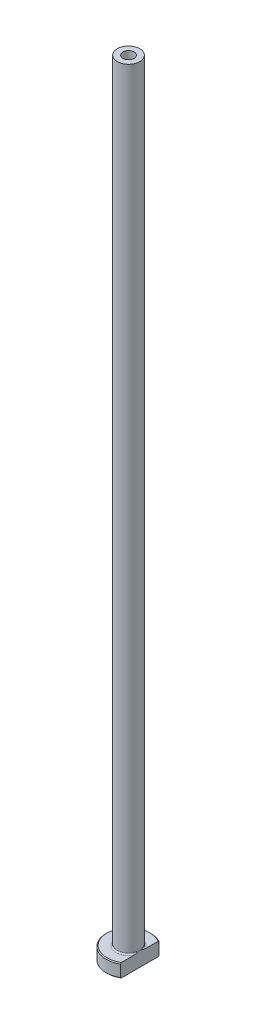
ISO-10303-21;
HEADER;
FILE_DESCRIPTION(('STEP AP214'),'2;1');
FILE_NAME('part.step','',(''),(''),'','','');
FILE_SCHEMA(('AUTOMOTIVE_DESIGN { 1 0 10303 214 1 1 1 1 }'));
ENDSEC;
DATA;
#1=APPLICATION_CONTEXT('core data for automotive mechanical design processes');
#2=APPLICATION_PROTOCOL_DEFINITION('international standard','automotive_design',2000,#1);
#3=PRODUCT_CONTEXT('',#1,'mechanical');
#4=PRODUCT('Part','Part','',(#3));
#5=PRODUCT_RELATED_PRODUCT_CATEGORY('part','',(#4));
#6=PRODUCT_DEFINITION_FORMATION('','',#4);
#7=PRODUCT_DEFINITION_CONTEXT('part definition',#1,'design');
#8=PRODUCT_DEFINITION('design','',#6,#7);
#9=PRODUCT_DEFINITION_SHAPE('','',#8);
#10=(LENGTH_UNIT() NAMED_UNIT(*) SI_UNIT(.MILLI.,.METRE.));
#11=(NAMED_UNIT(*) PLANE_ANGLE_UNIT() SI_UNIT($,.RADIAN.));
#12=(NAMED_UNIT(*) SI_UNIT($,.STERADIAN.) SOLID_ANGLE_UNIT());
#13=UNCERTAINTY_MEASURE_WITH_UNIT(LENGTH_MEASURE(1.E-05),#10,'distance_accuracy_value','');
#14=(GEOMETRIC_REPRESENTATION_CONTEXT(3) GLOBAL_UNCERTAINTY_ASSIGNED_CONTEXT((#13)) GLOBAL_UNIT_ASSIGNED_CONTEXT((#10,
#11,#12)) REPRESENTATION_CONTEXT('',''));
#15=CARTESIAN_POINT('',(0.,0.,0.));
#16=DIRECTION('',(0.,0.,1.));
#17=DIRECTION('',(1.,0.,0.));
#18=AXIS2_PLACEMENT_3D('',#15,#16,#17);
#19=CARTESIAN_POINT('',(0.,92.1876809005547,0.));
#20=DIRECTION('',(0.,1.,0.));
#21=DIRECTION('',(0.,0.,1.));
#22=AXIS2_PLACEMENT_3D('',#19,#20,#21);
#23=CYLINDRICAL_SURFACE('',#22,1.25);
#24=CARTESIAN_POINT('',(0.,175.,0.));
#25=DIRECTION('',(0.,1.,0.));
#26=DIRECTION('',(0.,0.,1.));
#27=AXIS2_PLACEMENT_3D('',#24,#25,#26);
#28=CIRCLE('',#27,1.25);
#29=CARTESIAN_POINT('',(0.,175.,1.25));
#30=VERTEX_POINT('',#29);
#31=EDGE_CURVE('E167',#30,#30,#28,.T.);
#32=ORIENTED_EDGE('',*,*,#31,.T.);
#33=EDGE_LOOP('',(#32));
#34=FACE_BOUND('',#33,.T.);
#35=CARTESIAN_POINT('',(0.,140.,0.));
#36=DIRECTION('',(0.,1.,0.));
#37=DIRECTION('',(0.,0.,1.));
#38=AXIS2_PLACEMENT_3D('',#35,#36,#37);
#39=CIRCLE('',#38,1.25);
#40=CARTESIAN_POINT('',(0.,140.,1.25));
#41=VERTEX_POINT('',#40);
#42=EDGE_CURVE('E170',#41,#41,#39,.T.);
#43=ORIENTED_EDGE('',*,*,#42,.F.);
#44=EDGE_LOOP('',(#43));
#45=FACE_BOUND('',#44,.T.);
#46=ADVANCED_FACE('F32',(#34,#45),#23,.F.);
#47=CARTESIAN_POINT('',(-1.25,175.,0.));
#48=DIRECTION('',(0.,1.,0.));
#49=DIRECTION('',(0.,0.,1.));
#50=AXIS2_PLACEMENT_3D('',#47,#48,#49);
#51=PLANE('',#50);
#52=CARTESIAN_POINT('',(0.,175.,0.));
#53=DIRECTION('',(0.,1.,0.));
#54=DIRECTION('',(0.,0.,1.));
#55=AXIS2_PLACEMENT_3D('',#52,#53,#54);
#56=CIRCLE('',#55,2.50000000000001);
#57=CARTESIAN_POINT('',(0.,175.,2.50000000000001));
#58=VERTEX_POINT('',#57);
#59=EDGE_CURVE('E174',#58,#58,#56,.T.);
#60=ORIENTED_EDGE('',*,*,#59,.T.);
#61=EDGE_LOOP('',(#60));
#62=FACE_BOUND('',#61,.T.);
#63=ORIENTED_EDGE('',*,*,#31,.F.);
#64=EDGE_LOOP('',(#63));
#65=FACE_BOUND('',#64,.T.);
#66=ADVANCED_FACE('F157',(#62,#65),#51,.T.);
#67=CARTESIAN_POINT('',(0.,92.1876809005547,0.));
#68=DIRECTION('',(0.,1.,0.));
#69=DIRECTION('',(0.,0.,1.));
#70=AXIS2_PLACEMENT_3D('',#67,#68,#69);
#71=CYLINDRICAL_SURFACE('',#70,2.5);
#72=CARTESIAN_POINT('',(0.,3.3,0.));
#73=DIRECTION('',(0.,1.,0.));
#74=DIRECTION('',(0.,0.,1.));
#75=AXIS2_PLACEMENT_3D('',#72,#73,#74);
#76=CIRCLE('',#75,2.5);
#77=CARTESIAN_POINT('',(2.5,3.3,0.));
#78=VERTEX_POINT('',#77);
#79=EDGE_CURVE('E180',#78,#78,#76,.T.);
#80=ORIENTED_EDGE('',*,*,#79,.T.);
#81=EDGE_LOOP('',(#80));
#82=FACE_BOUND('',#81,.T.);
#83=ORIENTED_EDGE('',*,*,#59,.F.);
#84=EDGE_LOOP('',(#83));
#85=FACE_BOUND('',#84,.T.);
#86=ADVANCED_FACE('F162',(#82,#85),#71,.T.);
#87=CARTESIAN_POINT('',(-2.49999999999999,3.,0.));
#88=DIRECTION('',(0.,1.,0.));
#89=DIRECTION('',(0.,0.,1.));
#90=AXIS2_PLACEMENT_3D('',#87,#88,#89);
#91=PLANE('',#90);
#92=DIRECTION('',(0.,0.,1.));
#93=VECTOR('',#92,1.);
#94=CARTESIAN_POINT('',(2.49999999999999,3.,0.));
#95=LINE('',#94,#93);
#96=CARTESIAN_POINT('',(2.5,3.,-4.09756024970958));
#97=VERTEX_POINT('',#96);
#98=CARTESIAN_POINT('',(2.49999999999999,3.,-1.26095202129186));
#99=VERTEX_POINT('',#98);
#100=EDGE_CURVE('E54',#97,#99,#95,.T.);
#101=ORIENTED_EDGE('',*,*,#100,.F.);
#102=CARTESIAN_POINT('',(0.,3.,0.));
#103=DIRECTION('',(0.,1.,0.));
#104=DIRECTION('',(0.,0.,1.));
#105=AXIS2_PLACEMENT_3D('',#102,#103,#104);
#106=CIRCLE('',#105,4.8);
#107=CARTESIAN_POINT('',(2.49999999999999,3.,4.09756024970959));
#108=VERTEX_POINT('',#107);
#109=EDGE_CURVE('E186',#97,#108,#106,.T.);
#110=ORIENTED_EDGE('',*,*,#109,.T.);
#111=CARTESIAN_POINT('',(2.49999999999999,3.,1.26095202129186));
#112=VERTEX_POINT('',#111);
#113=EDGE_CURVE('E134',#112,#108,#95,.T.);
#114=ORIENTED_EDGE('',*,*,#113,.F.);
#115=CARTESIAN_POINT('',(0.,3.,0.));
#116=DIRECTION('',(0.,1.,0.));
#117=DIRECTION('',(0.,0.,1.));
#118=AXIS2_PLACEMENT_3D('',#115,#116,#117);
#119=CIRCLE('',#118,2.8);
#120=EDGE_CURVE('E183',#112,#99,#119,.F.);
#121=ORIENTED_EDGE('',*,*,#120,.T.);
#122=EDGE_LOOP('',(#101,#110,#114,#121));
#123=FACE_BOUND('',#122,.T.);
#124=ADVANCED_FACE('F197',(#123),#91,.T.);
#125=CARTESIAN_POINT('',(0.,92.1876809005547,0.));
#126=DIRECTION('',(0.,1.,0.));
#127=DIRECTION('',(0.,0.,1.));
#128=AXIS2_PLACEMENT_3D('',#125,#126,#127);
#129=CYLINDRICAL_SURFACE('',#128,4.99999999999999);
#130=DIRECTION('',(0.,-1.,0.));
#131=VECTOR('',#130,1.);
#132=CARTESIAN_POINT('',(2.49999999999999,175.,4.33012701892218));
#133=LINE('',#132,#131);
#134=CARTESIAN_POINT('',(2.49999999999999,2.8,4.33012701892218));
#135=VERTEX_POINT('',#134);
#136=CARTESIAN_POINT('',(2.49999999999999,0.200000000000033,4.33012701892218));
#137=VERTEX_POINT('',#136);
#138=EDGE_CURVE('E82',#135,#137,#133,.T.);
#139=ORIENTED_EDGE('',*,*,#138,.F.);
#140=CARTESIAN_POINT('',(0.,2.8,0.));
#141=DIRECTION('',(0.,1.,0.));
#142=DIRECTION('',(0.,0.,1.));
#143=AXIS2_PLACEMENT_3D('',#140,#141,#142);
#144=CIRCLE('',#143,4.99999999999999);
#145=CARTESIAN_POINT('',(2.5,2.8,-4.33012701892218));
#146=VERTEX_POINT('',#145);
#147=EDGE_CURVE('E95',#135,#146,#144,.F.);
#148=ORIENTED_EDGE('',*,*,#147,.T.);
#149=DIRECTION('',(0.,-1.,0.));
#150=VECTOR('',#149,1.);
#151=CARTESIAN_POINT('',(2.5,175.,-4.33012701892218));
#152=LINE('',#151,#150);
#153=CARTESIAN_POINT('',(2.5,0.200000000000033,-4.33012701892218));
#154=VERTEX_POINT('',#153);
#155=EDGE_CURVE('E192',#146,#154,#152,.T.);
#156=ORIENTED_EDGE('',*,*,#155,.T.);
#157=CARTESIAN_POINT('',(0.,0.200000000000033,0.));
#158=DIRECTION('',(0.,-1.,0.));
#159=DIRECTION('',(0.,0.,-1.));
#160=AXIS2_PLACEMENT_3D('',#157,#158,#159);
#161=CIRCLE('',#160,4.99999999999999);
#162=EDGE_CURVE('E98',#154,#137,#161,.F.);
#163=ORIENTED_EDGE('',*,*,#162,.T.);
#164=EDGE_LOOP('',(#139,#148,#156,#163));
#165=FACE_BOUND('',#164,.T.);
#166=ADVANCED_FACE('F190',(#165),#129,.T.);
#167=CARTESIAN_POINT('',(-4.99999999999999,0.,0.));
#168=DIRECTION('',(0.,-1.,0.));
#169=DIRECTION('',(0.,0.,-1.));
#170=AXIS2_PLACEMENT_3D('',#167,#168,#169);
#171=PLANE('',#170);
#172=CARTESIAN_POINT('',(0.,0.,0.));
#173=DIRECTION('',(0.,-1.,0.));
#174=DIRECTION('',(0.,0.,-1.));
#175=AXIS2_PLACEMENT_3D('',#172,#173,#174);
#176=CIRCLE('',#175,1.99999999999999);
#177=CARTESIAN_POINT('',(0.,0.,-1.99999999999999));
#178=VERTEX_POINT('',#177);
#179=EDGE_CURVE('E40',#178,#178,#176,.F.);
#180=ORIENTED_EDGE('',*,*,#179,.T.);
#181=EDGE_LOOP('',(#180));
#182=FACE_BOUND('',#181,.T.);
#183=DIRECTION('',(0.,0.,-1.));
#184=VECTOR('',#183,1.);
#185=CARTESIAN_POINT('',(2.49999999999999,0.,4.33012701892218));
#186=LINE('',#185,#184);
#187=CARTESIAN_POINT('',(2.49999999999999,0.,4.09756024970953));
#188=VERTEX_POINT('',#187);
#189=CARTESIAN_POINT('',(2.5,0.,-4.09756024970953));
#190=VERTEX_POINT('',#189);
#191=EDGE_CURVE('E47',#188,#190,#186,.T.);
#192=ORIENTED_EDGE('',*,*,#191,.F.);
#193=CARTESIAN_POINT('',(0.,0.,0.));
#194=DIRECTION('',(0.,-1.,0.));
#195=DIRECTION('',(0.,0.,-1.));
#196=AXIS2_PLACEMENT_3D('',#193,#194,#195);
#197=CIRCLE('',#196,4.79999999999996);
#198=EDGE_CURVE('E92',#188,#190,#197,.T.);
#199=ORIENTED_EDGE('',*,*,#198,.T.);
#200=EDGE_LOOP('',(#192,#199));
#201=FACE_BOUND('',#200,.T.);
#202=ADVANCED_FACE('F91',(#182,#201),#171,.T.);
#203=CARTESIAN_POINT('',(0.,92.1876809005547,0.));
#204=DIRECTION('',(0.,1.,0.));
#205=DIRECTION('',(0.,0.,1.));
#206=AXIS2_PLACEMENT_3D('',#203,#204,#205);
#207=CYLINDRICAL_SURFACE('',#206,1.5);
#208=CARTESIAN_POINT('',(0.,0.499999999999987,0.));
#209=DIRECTION('',(0.,-1.,0.));
#210=DIRECTION('',(0.,0.,-1.));
#211=AXIS2_PLACEMENT_3D('',#208,#209,#210);
#212=CIRCLE('',#211,1.5);
#213=CARTESIAN_POINT('',(0.,0.499999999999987,-1.5));
#214=VERTEX_POINT('',#213);
#215=EDGE_CURVE('E11',#214,#214,#212,.T.);
#216=ORIENTED_EDGE('',*,*,#215,.T.);
#217=EDGE_LOOP('',(#216));
#218=FACE_BOUND('',#217,.T.);
#219=CARTESIAN_POINT('',(0.,128.,0.));
#220=DIRECTION('',(0.,1.,0.));
#221=DIRECTION('',(0.,0.,1.));
#222=AXIS2_PLACEMENT_3D('',#219,#220,#221);
#223=CIRCLE('',#222,1.50000000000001);
#224=CARTESIAN_POINT('',(0.,128.,1.50000000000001));
#225=VERTEX_POINT('',#224);
#226=EDGE_CURVE('E172',#225,#225,#223,.T.);
#227=ORIENTED_EDGE('',*,*,#226,.T.);
#228=EDGE_LOOP('',(#227));
#229=FACE_BOUND('',#228,.T.);
#230=ADVANCED_FACE('F215',(#218,#229),#207,.F.);
#231=CARTESIAN_POINT('',(0.,128.,0.));
#232=DIRECTION('',(0.,-1.,0.));
#233=DIRECTION('',(0.,0.,-1.));
#234=AXIS2_PLACEMENT_3D('',#231,#232,#233);
#235=CONICAL_SURFACE('',#234,1.50000000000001,0.0208303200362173);
#236=ORIENTED_EDGE('',*,*,#42,.T.);
#237=EDGE_LOOP('',(#236));
#238=FACE_BOUND('',#237,.T.);
#239=ORIENTED_EDGE('',*,*,#226,.F.);
#240=EDGE_LOOP('',(#239));
#241=FACE_BOUND('',#240,.T.);
#242=ADVANCED_FACE('F111',(#238,#241),#235,.F.);
#243=CARTESIAN_POINT('',(0.,3.3,0.));
#244=DIRECTION('',(0.,1.,0.));
#245=DIRECTION('',(0.,0.,1.));
#246=AXIS2_PLACEMENT_3D('',#243,#244,#245);
#247=TOROIDAL_SURFACE('',#246,2.8,0.3);
#248=ORIENTED_EDGE('',*,*,#120,.F.);
#249=CARTESIAN_POINT('',(2.5,3.3,0.));
#250=CARTESIAN_POINT('',(2.5,3.3000006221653,-4.84273808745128E-11));
#251=CARTESIAN_POINT('',(2.5,3.30000124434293,1.59621022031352E-07));
#252=CARTESIAN_POINT('',(2.5,3.30000243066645,6.45477892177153E-07));
#253=CARTESIAN_POINT('',(2.5,3.3000029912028,9.78480613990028E-07));
#254=CARTESIAN_POINT('',(2.5,3.3000041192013,1.77471968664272E-06));
#255=CARTESIAN_POINT('',(2.5,3.30000467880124,2.249021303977E-06));
#256=CARTESIAN_POINT('',(2.5,3.30000572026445,3.25953665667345E-06));
#257=CARTESIAN_POINT('',(2.5,3.30000620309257,3.79480728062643E-06));
#258=CARTESIAN_POINT('',(2.5,3.3000078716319,5.75794615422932E-06));
#259=CARTESIAN_POINT('',(2.5,3.30000896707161,7.2642410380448E-06));
#260=CARTESIAN_POINT('',(2.5,3.30001087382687,1.0336112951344E-05));
#261=CARTESIAN_POINT('',(2.5,3.30001169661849,1.18949499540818E-05));
#262=CARTESIAN_POINT('',(2.5,3.30001489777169,1.81400853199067E-05));
#263=CARTESIAN_POINT('',(2.5,3.300017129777,2.29062180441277E-05));
#264=CARTESIAN_POINT('',(2.5,3.30002067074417,3.21793870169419E-05));
#265=CARTESIAN_POINT('',(2.5,3.30002205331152,3.66588991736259E-05));
#266=CARTESIAN_POINT('',(2.5,3.30002810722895,5.61718409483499E-05));
#267=CARTESIAN_POINT('',(2.5,3.30003284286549,7.11735872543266E-05));
#268=CARTESIAN_POINT('',(2.49999999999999,3.30004025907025,9.89920336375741E-05));
#269=CARTESIAN_POINT('',(2.5,3.3000431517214,0.000111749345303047));
#270=CARTESIAN_POINT('',(2.5,3.30006652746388,0.000206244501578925));
#271=CARTESIAN_POINT('',(2.5,3.30009698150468,0.000285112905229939));
#272=CARTESIAN_POINT('',(2.49999999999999,3.30021213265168,0.000594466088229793));
#273=CARTESIAN_POINT('',(2.49999999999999,3.30028938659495,0.000826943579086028));
#274=CARTESIAN_POINT('',(2.5,3.30059681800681,0.0017388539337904));
#275=CARTESIAN_POINT('',(2.5,3.30083479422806,0.00241625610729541));
#276=CARTESIAN_POINT('',(2.49999999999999,3.30181198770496,0.00521069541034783));
#277=CARTESIAN_POINT('',(2.49999999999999,3.30254240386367,0.0073299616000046));
#278=CARTESIAN_POINT('',(2.5,3.31226043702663,0.0355096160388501));
#279=CARTESIAN_POINT('',(2.5,3.32130808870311,0.0615551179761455));
#280=CARTESIAN_POINT('',(2.49999999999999,3.33896212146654,0.112677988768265));
#281=CARTESIAN_POINT('',(2.49999999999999,3.34757212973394,0.137754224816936));
#282=CARTESIAN_POINT('',(2.5,3.36573068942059,0.190981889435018));
#283=CARTESIAN_POINT('',(2.5,3.37526654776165,0.219137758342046));
#284=CARTESIAN_POINT('',(2.5,3.39422867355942,0.275816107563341));
#285=CARTESIAN_POINT('',(2.5,3.40365272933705,0.304339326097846));
#286=CARTESIAN_POINT('',(2.5,3.42641697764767,0.374416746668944));
#287=CARTESIAN_POINT('',(2.5,3.43959811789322,0.416023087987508));
#288=CARTESIAN_POINT('',(2.5,3.46479157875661,0.49848190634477));
#289=CARTESIAN_POINT('',(2.5,3.47682455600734,0.539328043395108));
#290=CARTESIAN_POINT('',(2.5,3.50224427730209,0.629981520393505));
#291=CARTESIAN_POINT('',(2.5,3.51538048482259,0.679860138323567));
#292=CARTESIAN_POINT('',(2.5,3.53964074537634,0.7805117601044));
#293=CARTESIAN_POINT('',(2.5,3.55074877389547,0.831288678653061));
#294=CARTESIAN_POINT('',(2.5,3.57087054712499,0.937063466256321));
#295=CARTESIAN_POINT('',(2.5,3.57967623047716,0.992102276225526));
#296=CARTESIAN_POINT('',(2.5,3.59301148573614,1.10256024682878));
#297=CARTESIAN_POINT('',(2.5,3.59755297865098,1.15797790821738));
#298=CARTESIAN_POINT('',(2.5,3.60093314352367,1.26786705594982));
#299=CARTESIAN_POINT('',(2.5,3.59989366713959,1.32233291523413));
#300=CARTESIAN_POINT('',(2.5,3.59277279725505,1.40310062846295));
#301=CARTESIAN_POINT('',(2.5,3.58952137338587,1.42965222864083));
#302=CARTESIAN_POINT('',(2.5,3.58085857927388,1.48239078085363));
#303=CARTESIAN_POINT('',(2.5,3.57544928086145,1.50857805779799));
#304=CARTESIAN_POINT('',(2.5,3.56298810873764,1.55658799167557));
#305=CARTESIAN_POINT('',(2.5,3.5562820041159,1.5784990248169));
#306=CARTESIAN_POINT('',(2.5,3.5405539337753,1.62160292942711));
#307=CARTESIAN_POINT('',(2.5,3.5315222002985,1.64279233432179));
#308=CARTESIAN_POINT('',(2.5,3.51057199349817,1.68404469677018));
#309=CARTESIAN_POINT('',(2.5,3.49862012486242,1.70409105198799));
#310=CARTESIAN_POINT('',(2.5,3.47134074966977,1.74172093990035));
#311=CARTESIAN_POINT('',(2.5,3.45603127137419,1.75931683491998));
#312=CARTESIAN_POINT('',(2.5,3.42979930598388,1.78297070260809));
#313=CARTESIAN_POINT('',(2.5,3.42024268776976,1.79054141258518));
#314=CARTESIAN_POINT('',(2.5,3.40009035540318,1.80416997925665));
#315=CARTESIAN_POINT('',(2.5,3.3894949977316,1.81022835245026));
#316=CARTESIAN_POINT('',(2.5,3.36727740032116,1.82047087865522));
#317=CARTESIAN_POINT('',(2.5,3.3556453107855,1.82463409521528));
#318=CARTESIAN_POINT('',(2.5,3.33178837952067,1.83058442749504));
#319=CARTESIAN_POINT('',(2.5,3.31956435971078,1.83237474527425));
#320=CARTESIAN_POINT('',(2.5,3.29665736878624,1.83331852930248));
#321=CARTESIAN_POINT('',(2.5,3.2859867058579,1.83279233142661));
#322=CARTESIAN_POINT('',(2.5,3.26490749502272,1.82986307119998));
#323=CARTESIAN_POINT('',(2.5,3.25449899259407,1.82745968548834));
#324=CARTESIAN_POINT('',(2.5,3.23467098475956,1.82111257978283));
#325=CARTESIAN_POINT('',(2.5,3.22522816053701,1.81724026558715));
#326=CARTESIAN_POINT('',(2.5,3.20699535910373,1.80819497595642));
#327=CARTESIAN_POINT('',(2.5,3.19820556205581,1.80302164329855));
#328=CARTESIAN_POINT('',(2.5,3.17663162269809,1.78842115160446));
#329=CARTESIAN_POINT('',(2.5,3.16436228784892,1.7782329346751));
#330=CARTESIAN_POINT('',(2.5,3.14157828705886,1.75604629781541));
#331=CARTESIAN_POINT('',(2.5,3.13106906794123,1.74404246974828));
#332=CARTESIAN_POINT('',(2.5,3.10600520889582,1.71142114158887));
#333=CARTESIAN_POINT('',(2.5,3.09267476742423,1.68986887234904));
#334=CARTESIAN_POINT('',(2.5,3.06940323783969,1.64508572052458));
#335=CARTESIAN_POINT('',(2.5,3.05946314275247,1.62185434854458));
#336=CARTESIAN_POINT('',(2.5,3.03545750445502,1.55546754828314));
#337=CARTESIAN_POINT('',(2.5,3.02444022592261,1.51122187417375));
#338=CARTESIAN_POINT('',(2.5,3.00863926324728,1.4211977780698));
#339=CARTESIAN_POINT('',(2.5,3.00393876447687,1.37540689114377));
#340=CARTESIAN_POINT('',(2.5,2.9992421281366,1.28072198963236));
#341=CARTESIAN_POINT('',(2.5,2.99956098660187,1.23181420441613));
#342=CARTESIAN_POINT('',(2.5,3.00436098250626,1.13410944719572));
#343=CARTESIAN_POINT('',(2.5,3.00885327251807,1.0853131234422));
#344=CARTESIAN_POINT('',(2.5,3.02074191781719,0.990773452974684));
#345=CARTESIAN_POINT('',(2.5,3.02796792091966,0.94500781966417));
#346=CARTESIAN_POINT('',(2.5,3.04465555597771,0.854199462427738));
#347=CARTESIAN_POINT('',(2.5,3.05410250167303,0.809153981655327));
#348=CARTESIAN_POINT('',(2.5,3.07710029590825,0.709411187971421));
#349=CARTESIAN_POINT('',(2.5,3.09109633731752,0.654817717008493));
#350=CARTESIAN_POINT('',(2.5,3.12140740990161,0.54486362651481));
#351=CARTESIAN_POINT('',(2.49999999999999,3.13777040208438,0.489516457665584));
#352=CARTESIAN_POINT('',(2.5,3.16649540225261,0.396740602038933));
#353=CARTESIAN_POINT('',(2.5,3.17848130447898,0.359193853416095));
#354=CARTESIAN_POINT('',(2.49999999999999,3.20280507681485,0.284651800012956));
#355=CARTESIAN_POINT('',(2.49999999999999,3.21513791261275,0.247654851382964));
#356=CARTESIAN_POINT('',(2.5,3.23873713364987,0.177767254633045));
#357=CARTESIAN_POINT('',(2.5,3.24997409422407,0.144866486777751));
#358=CARTESIAN_POINT('',(2.49999999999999,3.27307149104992,0.0777985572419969));
#359=CARTESIAN_POINT('',(2.49999999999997,3.28493883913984,0.0436336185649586));
#360=CARTESIAN_POINT('',(2.5,3.29745794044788,0.0073287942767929));
#361=CARTESIAN_POINT('',(2.5,3.29818879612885,0.00520838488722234));
#362=CARTESIAN_POINT('',(2.49999999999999,3.29916610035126,0.00241367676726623));
#363=CARTESIAN_POINT('',(2.49999999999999,3.29940376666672,0.00173715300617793));
#364=CARTESIAN_POINT('',(2.5,3.29971082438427,0.000826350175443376));
#365=CARTESIAN_POINT('',(2.5,3.29978800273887,0.000594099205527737));
#366=CARTESIAN_POINT('',(2.49999999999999,3.299903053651,0.000285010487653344));
#367=CARTESIAN_POINT('',(2.49999999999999,3.2999334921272,0.000206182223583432));
#368=CARTESIAN_POINT('',(2.5,3.29995685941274,0.000111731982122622));
#369=CARTESIAN_POINT('',(2.5,3.29995975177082,9.89774327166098E-05));
#370=CARTESIAN_POINT('',(2.5,3.29996716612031,7.11651886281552E-05));
#371=CARTESIAN_POINT('',(2.5,3.29997189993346,5.61668096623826E-05));
#372=CARTESIAN_POINT('',(2.5,3.29997795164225,3.66576327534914E-05));
#373=CARTESIAN_POINT('',(2.5,3.2999793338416,3.21785244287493E-05));
#374=CARTESIAN_POINT('',(2.5,3.29998287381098,2.29061373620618E-05));
#375=CARTESIAN_POINT('',(2.5,3.2999851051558,1.81403659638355E-05));
#376=CARTESIAN_POINT('',(2.5,3.29998830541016,1.1895582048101E-05));
#377=CARTESIAN_POINT('',(2.5,3.29998912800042,1.03367760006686E-05));
#378=CARTESIAN_POINT('',(2.5,3.29999103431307,7.26492761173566E-06));
#379=CARTESIAN_POINT('',(2.5,3.29999212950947,5.75862257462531E-06));
#380=CARTESIAN_POINT('',(2.5,3.2999937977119,3.79542444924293E-06));
#381=CARTESIAN_POINT('',(2.5,3.29999428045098,3.26012738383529E-06));
#382=CARTESIAN_POINT('',(2.5,3.29999532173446,2.2495431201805E-06));
#383=CARTESIAN_POINT('',(2.5,3.29999588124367,1.77519875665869E-06));
#384=CARTESIAN_POINT('',(2.5,3.29999700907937,9.78856956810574E-07));
#385=CARTESIAN_POINT('',(2.5,3.29999756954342,6.45796946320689E-07));
#386=CARTESIAN_POINT('',(2.5,3.2999987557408,1.59799561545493E-07));
#387=CARTESIAN_POINT('',(2.5,3.29999937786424,4.84255823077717E-11));
#388=CARTESIAN_POINT('',(2.5,3.3,0.));
#389=B_SPLINE_CURVE_WITH_KNOTS('',3,(#249,#250,#251,#252,#253,#254,#255,#256,#257,#258,#259,
#260,#261,#262,#263,#264,#265,#266,#267,#268,#269,#270,#271,#272,#273,#274,#275,#276,#277,#278,
#279,#280,#281,#282,#283,#284,#285,#286,#287,#288,#289,#290,#291,#292,#293,#294,#295,#296,#297,
#298,#299,#300,#301,#302,#303,#304,#305,#306,#307,#308,#309,#310,#311,#312,#313,#314,#315,#316,
#317,#318,#319,#320,#321,#322,#323,#324,#325,#326,#327,#328,#329,#330,#331,#332,#333,#334,#335,
#336,#337,#338,#339,#340,#341,#342,#343,#344,#345,#346,#347,#348,#349,#350,#351,#352,#353,#354,
#355,#356,#357,#358,#359,#360,#361,#362,#363,#364,#365,#366,#367,#368,#369,#370,#371,#372,#373,
#374,#375,#376,#377,#378,#379,#380,#381,#382,#383,#384,#385,#386,#387,#388),.UNSPECIFIED.,.T.,
.F.,(4,2,2,2,2,2,2,2,2,2,2,2,2,2,2,2,2,2,2,2,2,2,2,2,2,2,2,2,2,2,2,2,2,2,2,2,2,2,2,2,2,2,2,2,2,
2,2,2,2,2,2,2,2,2,2,2,2,2,2,2,2,2,2,2,2,2,2,2,2,4),(0.,1.86789240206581E-06,
3.81549625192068E-06,6.00610486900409E-06,8.16652987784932E-06,1.37285591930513E-05,
1.90122173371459E-05,3.47597293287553E-05,4.88082622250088E-05,9.59978452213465E-05,
0.000135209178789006,0.000388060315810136,0.00112364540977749,0.0032767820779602,
0.0100024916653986,0.0927120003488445,0.172253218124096,0.261432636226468,0.351551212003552,
0.48247714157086,0.610212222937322,0.76491521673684,0.920792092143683,1.08787897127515,
1.25449733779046,1.41749285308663,1.49767530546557,1.57778095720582,1.6464248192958,
1.71536183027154,1.78512750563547,1.8545273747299,1.89099315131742,1.92744645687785,
1.96429324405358,2.00109025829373,2.0329710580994,2.06485735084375,2.09535926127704,
2.12586955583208,2.17344034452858,2.2211557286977,2.29675134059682,2.37236907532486,
2.50839721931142,2.64619971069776,2.79268284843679,2.93955855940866,3.07848421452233,
3.21651583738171,3.38554045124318,3.55865938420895,3.67689643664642,3.79388863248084,
3.89819085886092,4.00668323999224,4.01341261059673,4.01556295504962,4.01629782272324,
4.01655054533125,4.01658974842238,4.01663692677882,4.01665097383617,4.01666671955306,
4.01667200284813,4.01667756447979,4.01667972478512,4.01668191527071,4.01668386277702,
4.01668573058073),.UNSPECIFIED.);
#390=EDGE_CURVE('E126',#112,#78,#389,.T.);
#391=ORIENTED_EDGE('',*,*,#390,.T.);
#392=ORIENTED_EDGE('',*,*,#79,.F.);
#393=CARTESIAN_POINT('',(2.5,3.3,0.));
#394=CARTESIAN_POINT('',(2.5,3.2999993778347,4.84277324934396E-11));
#395=CARTESIAN_POINT('',(2.5,3.29999875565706,-1.596210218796E-07));
#396=CARTESIAN_POINT('',(2.5,3.29999756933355,-6.45477892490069E-07));
#397=CARTESIAN_POINT('',(2.5,3.2999970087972,-9.78480614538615E-07));
#398=CARTESIAN_POINT('',(2.5,3.2999958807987,-1.77471968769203E-06));
#399=CARTESIAN_POINT('',(2.5,3.29999532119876,-2.2490213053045E-06));
#400=CARTESIAN_POINT('',(2.5,3.29999427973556,-3.25953665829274E-06));
#401=CARTESIAN_POINT('',(2.5,3.29999379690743,-3.79480728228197E-06));
#402=CARTESIAN_POINT('',(2.5,3.2999921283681,-5.75794615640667E-06));
#403=CARTESIAN_POINT('',(2.5,3.29999103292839,-7.26424104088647E-06));
#404=CARTESIAN_POINT('',(2.5,3.29998912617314,-1.03361129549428E-05));
#405=CARTESIAN_POINT('',(2.5,3.29998830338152,-1.18949499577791E-05));
#406=CARTESIAN_POINT('',(2.5,3.29998510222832,-1.81400853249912E-05));
#407=CARTESIAN_POINT('',(2.5,3.29998287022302,-2.29062180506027E-05));
#408=CARTESIAN_POINT('',(2.5,3.29997932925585,-3.21793870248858E-05));
#409=CARTESIAN_POINT('',(2.5,3.2999779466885,-3.66588991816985E-05));
#410=CARTESIAN_POINT('',(2.5,3.29997189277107,-5.61718409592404E-05));
#411=CARTESIAN_POINT('',(2.5,3.29996715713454,-7.11735872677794E-05));
#412=CARTESIAN_POINT('',(2.5,3.29995974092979,-9.89920336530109E-05));
#413=CARTESIAN_POINT('',(2.5,3.29995684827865,-0.000111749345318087));
#414=CARTESIAN_POINT('',(2.49999999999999,3.29993347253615,-0.000206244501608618));
#415=CARTESIAN_POINT('',(2.49999999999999,3.29990301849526,-0.000285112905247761));
#416=CARTESIAN_POINT('',(2.5,3.29978786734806,-0.000594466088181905));
#417=CARTESIAN_POINT('',(2.5,3.29971061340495,-0.000826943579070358));
#418=CARTESIAN_POINT('',(2.49999999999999,3.29940318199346,-0.00173885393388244));
#419=CARTESIAN_POINT('',(2.49999999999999,3.29916520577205,-0.00241625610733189));
#420=CARTESIAN_POINT('',(2.5,3.29818801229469,-0.00521069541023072));
#421=CARTESIAN_POINT('',(2.5,3.29745759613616,-0.00732996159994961));
#422=CARTESIAN_POINT('',(2.49999999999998,3.28773956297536,-0.0355096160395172));
#423=CARTESIAN_POINT('',(2.49999999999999,3.27869191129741,-0.061555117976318));
#424=CARTESIAN_POINT('',(2.5,3.26103787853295,-0.112677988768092));
#425=CARTESIAN_POINT('',(2.5,3.25242787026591,-0.137754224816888));
#426=CARTESIAN_POINT('',(2.49999999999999,3.23426931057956,-0.190981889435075));
#427=CARTESIAN_POINT('',(2.49999999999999,3.22473345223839,-0.219137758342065));
#428=CARTESIAN_POINT('',(2.5,3.20577132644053,-0.275816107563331));
#429=CARTESIAN_POINT('',(2.5,3.19634727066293,-0.304339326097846));
#430=CARTESIAN_POINT('',(2.5,3.17358302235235,-0.374416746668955));
#431=CARTESIAN_POINT('',(2.5,3.16040188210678,-0.416023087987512));
#432=CARTESIAN_POINT('',(2.5,3.13520842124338,-0.498481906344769));
#433=CARTESIAN_POINT('',(2.5,3.12317544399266,-0.539328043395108));
#434=CARTESIAN_POINT('',(2.5,3.0977557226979,-0.629981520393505));
#435=CARTESIAN_POINT('',(2.5,3.0846195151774,-0.679860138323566));
#436=CARTESIAN_POINT('',(2.5,3.06035925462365,-0.780511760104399));
#437=CARTESIAN_POINT('',(2.5,3.04925122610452,-0.83128867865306));
#438=CARTESIAN_POINT('',(2.5,3.02912945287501,-0.93706346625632));
#439=CARTESIAN_POINT('',(2.5,3.02032376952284,-0.992102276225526));
#440=CARTESIAN_POINT('',(2.5,3.00698851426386,-1.10256024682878));
#441=CARTESIAN_POINT('',(2.5,3.00244702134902,-1.15797790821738));
#442=CARTESIAN_POINT('',(2.5,2.99906685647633,-1.26786705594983));
#443=CARTESIAN_POINT('',(2.5,3.00010633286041,-1.32233291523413));
#444=CARTESIAN_POINT('',(2.5,3.00722720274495,-1.40310062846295));
#445=CARTESIAN_POINT('',(2.5,3.01047862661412,-1.42965222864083));
#446=CARTESIAN_POINT('',(2.5,3.01914142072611,-1.48239078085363));
#447=CARTESIAN_POINT('',(2.5,3.02455071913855,-1.508578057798));
#448=CARTESIAN_POINT('',(2.5,3.03701189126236,-1.55658799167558));
#449=CARTESIAN_POINT('',(2.5,3.0437179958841,-1.57849902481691));
#450=CARTESIAN_POINT('',(2.5,3.0594460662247,-1.62160292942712));
#451=CARTESIAN_POINT('',(2.5,3.06847779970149,-1.64279233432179));
#452=CARTESIAN_POINT('',(2.5,3.08942800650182,-1.68404469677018));
#453=CARTESIAN_POINT('',(2.5,3.10137987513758,-1.70409105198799));
#454=CARTESIAN_POINT('',(2.5,3.12865925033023,-1.74172093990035));
#455=CARTESIAN_POINT('',(2.5,3.14396872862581,-1.75931683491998));
#456=CARTESIAN_POINT('',(2.5,3.17020069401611,-1.78297070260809));
#457=CARTESIAN_POINT('',(2.5,3.17975731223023,-1.79054141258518));
#458=CARTESIAN_POINT('',(2.5,3.19990964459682,-1.80416997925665));
#459=CARTESIAN_POINT('',(2.5,3.21050500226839,-1.81022835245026));
#460=CARTESIAN_POINT('',(2.5,3.23272259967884,-1.82047087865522));
#461=CARTESIAN_POINT('',(2.5,3.2443546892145,-1.82463409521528));
#462=CARTESIAN_POINT('',(2.5,3.26821162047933,-1.83058442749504));
#463=CARTESIAN_POINT('',(2.5,3.28043564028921,-1.83237474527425));
#464=CARTESIAN_POINT('',(2.5,3.30334263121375,-1.83331852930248));
#465=CARTESIAN_POINT('',(2.5,3.3140132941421,-1.83279233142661));
#466=CARTESIAN_POINT('',(2.5,3.33509250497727,-1.82986307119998));
#467=CARTESIAN_POINT('',(2.5,3.34550100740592,-1.82745968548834));
#468=CARTESIAN_POINT('',(2.5,3.36532901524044,-1.82111257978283));
#469=CARTESIAN_POINT('',(2.5,3.37477183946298,-1.81724026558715));
#470=CARTESIAN_POINT('',(2.5,3.39300464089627,-1.80819497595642));
#471=CARTESIAN_POINT('',(2.5,3.40179443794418,-1.80302164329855));
#472=CARTESIAN_POINT('',(2.5,3.4233683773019,-1.78842115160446));
#473=CARTESIAN_POINT('',(2.5,3.43563771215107,-1.7782329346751));
#474=CARTESIAN_POINT('',(2.5,3.45842171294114,-1.75604629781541));
#475=CARTESIAN_POINT('',(2.5,3.46893093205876,-1.74404246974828));
#476=CARTESIAN_POINT('',(2.5,3.49399479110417,-1.71142114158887));
#477=CARTESIAN_POINT('',(2.5,3.50732523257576,-1.68986887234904));
#478=CARTESIAN_POINT('',(2.5,3.53059676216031,-1.64508572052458));
#479=CARTESIAN_POINT('',(2.5,3.54053685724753,-1.62185434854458));
#480=CARTESIAN_POINT('',(2.5,3.56454249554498,-1.55546754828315));
#481=CARTESIAN_POINT('',(2.5,3.57555977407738,-1.51122187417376));
#482=CARTESIAN_POINT('',(2.5,3.59136073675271,-1.4211977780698));
#483=CARTESIAN_POINT('',(2.5,3.59606123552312,-1.37540689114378));
#484=CARTESIAN_POINT('',(2.5,3.6007578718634,-1.28072198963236));
#485=CARTESIAN_POINT('',(2.5,3.60043901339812,-1.23181420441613));
#486=CARTESIAN_POINT('',(2.5,3.59563901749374,-1.13410944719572));
#487=CARTESIAN_POINT('',(2.5,3.59114672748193,-1.08531312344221));
#488=CARTESIAN_POINT('',(2.5,3.57925808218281,-0.990773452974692));
#489=CARTESIAN_POINT('',(2.5,3.57203207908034,-0.945007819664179));
#490=CARTESIAN_POINT('',(2.5,3.55534444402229,-0.854199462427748));
#491=CARTESIAN_POINT('',(2.5,3.54589749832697,-0.809153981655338));
#492=CARTESIAN_POINT('',(2.5,3.52289970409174,-0.709411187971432));
#493=CARTESIAN_POINT('',(2.5,3.50890366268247,-0.654817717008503));
#494=CARTESIAN_POINT('',(2.5,3.47859259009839,-0.544863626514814));
#495=CARTESIAN_POINT('',(2.49999999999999,3.46222959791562,-0.489516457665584));
#496=CARTESIAN_POINT('',(2.5,3.43350459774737,-0.396740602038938));
#497=CARTESIAN_POINT('',(2.5,3.42151869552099,-0.359193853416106));
#498=CARTESIAN_POINT('',(2.49999999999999,3.39719492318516,-0.284651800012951));
#499=CARTESIAN_POINT('',(2.49999999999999,3.38486208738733,-0.247654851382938));
#500=CARTESIAN_POINT('',(2.5,3.36126286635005,-0.177767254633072));
#501=CARTESIAN_POINT('',(2.5,3.35002590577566,-0.144866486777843));
#502=CARTESIAN_POINT('',(2.49999999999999,3.32692850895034,-0.0777985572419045));
#503=CARTESIAN_POINT('',(2.49999999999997,3.31506116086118,-0.0436336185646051));
#504=CARTESIAN_POINT('',(2.5,3.30254205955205,-0.00732879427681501));
#505=CARTESIAN_POINT('',(2.5,3.30181120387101,-0.00520838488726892));
#506=CARTESIAN_POINT('',(2.49999999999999,3.30083389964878,-0.00241367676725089));
#507=CARTESIAN_POINT('',(2.49999999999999,3.30059623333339,-0.00173715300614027));
#508=CARTESIAN_POINT('',(2.5,3.30028917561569,-0.000826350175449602));
#509=CARTESIAN_POINT('',(2.5,3.30021199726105,-0.000594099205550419));
#510=CARTESIAN_POINT('',(2.49999999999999,3.30009694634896,-0.000285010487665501));
#511=CARTESIAN_POINT('',(2.49999999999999,3.30006650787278,-0.000206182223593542));
#512=CARTESIAN_POINT('',(2.5,3.30004314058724,-0.000111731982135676));
#513=CARTESIAN_POINT('',(2.5,3.30004024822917,-9.89774327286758E-05));
#514=CARTESIAN_POINT('',(2.5,3.30003283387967,-7.11651886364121E-05));
#515=CARTESIAN_POINT('',(2.5,3.30002810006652,-5.61668096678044E-05));
#516=CARTESIAN_POINT('',(2.5,3.30002204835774,-3.66576327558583E-05));
#517=CARTESIAN_POINT('',(2.5,3.30002066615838,-3.21785244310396E-05));
#518=CARTESIAN_POINT('',(2.5,3.300017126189,-2.29061373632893E-05));
#519=CARTESIAN_POINT('',(2.5,3.30001489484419,-1.81403659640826E-05));
#520=CARTESIAN_POINT('',(2.5,3.30001169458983,-1.18955820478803E-05));
#521=CARTESIAN_POINT('',(2.5,3.30001087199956,-1.03367760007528E-05));
#522=CARTESIAN_POINT('',(2.5,3.30000896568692,-7.26492761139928E-06));
#523=CARTESIAN_POINT('',(2.5,3.30000787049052,-5.75862257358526E-06));
#524=CARTESIAN_POINT('',(2.5,3.30000620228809,-3.79542444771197E-06));
#525=CARTESIAN_POINT('',(2.5,3.30000571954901,-3.26012738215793E-06));
#526=CARTESIAN_POINT('',(2.5,3.30000467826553,-2.24954311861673E-06));
#527=CARTESIAN_POINT('',(2.5,3.30000411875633,-1.77519875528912E-06));
#528=CARTESIAN_POINT('',(2.5,3.30000299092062,-9.78856955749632E-07));
#529=CARTESIAN_POINT('',(2.5,3.30000243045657,-6.45796945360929E-07));
#530=CARTESIAN_POINT('',(2.5,3.30000124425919,-1.59799560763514E-07));
#531=CARTESIAN_POINT('',(2.5,3.30000062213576,-4.8424932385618E-11));
#532=CARTESIAN_POINT('',(2.5,3.3,0.));
#533=B_SPLINE_CURVE_WITH_KNOTS('',3,(#393,#394,#395,#396,#397,#398,#399,#400,#401,#402,#403,
#404,#405,#406,#407,#408,#409,#410,#411,#412,#413,#414,#415,#416,#417,#418,#419,#420,#421,#422,
#423,#424,#425,#426,#427,#428,#429,#430,#431,#432,#433,#434,#435,#436,#437,#438,#439,#440,#441,
#442,#443,#444,#445,#446,#447,#448,#449,#450,#451,#452,#453,#454,#455,#456,#457,#458,#459,#460,
#461,#462,#463,#464,#465,#466,#467,#468,#469,#470,#471,#472,#473,#474,#475,#476,#477,#478,#479,
#480,#481,#482,#483,#484,#485,#486,#487,#488,#489,#490,#491,#492,#493,#494,#495,#496,#497,#498,
#499,#500,#501,#502,#503,#504,#505,#506,#507,#508,#509,#510,#511,#512,#513,#514,#515,#516,#517,
#518,#519,#520,#521,#522,#523,#524,#525,#526,#527,#528,#529,#530,#531,#532),.UNSPECIFIED.,.T.,
.F.,(4,2,2,2,2,2,2,2,2,2,2,2,2,2,2,2,2,2,2,2,2,2,2,2,2,2,2,2,2,2,2,2,2,2,2,2,2,2,2,2,2,2,2,2,2,
2,2,2,2,2,2,2,2,2,2,2,2,2,2,2,2,2,2,2,2,2,2,2,2,4),(0.,1.86789240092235E-06,
3.81549624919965E-06,6.0061048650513E-06,8.16652987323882E-06,1.37285591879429E-05,
1.90122173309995E-05,3.47597293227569E-05,4.88082622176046E-05,9.59978452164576E-05,
0.000135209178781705,0.000388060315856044,0.00112364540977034,0.00327678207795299,
0.0100024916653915,0.0927120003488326,0.172253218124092,0.261432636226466,0.35155121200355,
0.482477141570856,0.610212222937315,0.764915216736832,0.920792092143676,1.08787897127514,
1.25449733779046,1.41749285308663,1.49767530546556,1.57778095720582,1.64642481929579,
1.71536183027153,1.78512750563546,1.85452737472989,1.89099315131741,1.92744645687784,
1.96429324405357,2.00109025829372,2.03297105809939,2.06485735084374,2.09535926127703,
2.12586955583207,2.17344034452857,2.2211557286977,2.29675134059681,2.37236907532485,
2.50839721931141,2.64619971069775,2.79268284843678,2.93955855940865,3.07848421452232,
3.21651583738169,3.38554045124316,3.55865938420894,3.67689643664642,3.79388863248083,
3.89819085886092,4.00668323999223,4.01341261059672,4.01556295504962,4.01629782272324,
4.01655054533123,4.01658974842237,4.01663692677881,4.01665097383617,4.01666671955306,
4.01667200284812,4.01667756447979,4.01667972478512,4.01668191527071,4.01668386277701,
4.01668573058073),.UNSPECIFIED.);
#534=EDGE_CURVE('E135',#78,#99,#533,.T.);
#535=ORIENTED_EDGE('',*,*,#534,.T.);
#536=EDGE_LOOP('',(#248,#391,#392,#535));
#537=FACE_BOUND('',#536,.T.);
#538=ADVANCED_FACE('F141',(#537),#247,.F.);
#539=CARTESIAN_POINT('',(0.,3.,0.));
#540=DIRECTION('',(0.,-1.,0.));
#541=DIRECTION('',(0.,0.,-1.));
#542=AXIS2_PLACEMENT_3D('',#539,#540,#541);
#543=CONICAL_SURFACE('',#542,4.8,0.785398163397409);
#544=CARTESIAN_POINT('',(2.5,-2.05039133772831,-9.52786489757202));
#545=CARTESIAN_POINT('',(2.5,-1.84160367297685,-9.31199733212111));
#546=CARTESIAN_POINT('',(2.5,-1.63304008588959,-9.09591231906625));
#547=CARTESIAN_POINT('',(2.5,-1.21649358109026,-8.66317810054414));
#548=CARTESIAN_POINT('',(2.5,-1.00851067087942,-8.44652888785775));
#549=CARTESIAN_POINT('',(2.5,-0.593157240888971,-8.01243155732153));
#550=CARTESIAN_POINT('',(2.5,-0.385787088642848,-7.79498308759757));
#551=CARTESIAN_POINT('',(2.5,0.0280365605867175,-7.35921771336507));
#552=CARTESIAN_POINT('',(2.5,0.234490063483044,-7.14090081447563));
#553=CARTESIAN_POINT('',(2.5,0.642130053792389,-6.70748960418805));
#554=CARTESIAN_POINT('',(2.5,0.84333981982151,-6.49241720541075));
#555=CARTESIAN_POINT('',(2.5,1.24425381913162,-6.06087422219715));
#556=CARTESIAN_POINT('',(2.5,1.44395806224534,-5.84440364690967));
#557=CARTESIAN_POINT('',(2.5,1.84127751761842,-5.40963663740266));
#558=CARTESIAN_POINT('',(2.5,2.03889317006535,-5.19134060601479));
#559=CARTESIAN_POINT('',(2.5,2.43125043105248,-4.75218509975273));
#560=CARTESIAN_POINT('',(2.5,2.62599215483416,-4.53132572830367));
#561=CARTESIAN_POINT('',(2.5,2.93693788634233,-4.17181619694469));
#562=CARTESIAN_POINT('',(2.5,3.0544649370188,-4.03431188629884));
#563=CARTESIAN_POINT('',(2.5,3.28742704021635,-3.75751486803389));
#564=CARTESIAN_POINT('',(2.5,3.40286188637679,-3.61822198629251));
#565=CARTESIAN_POINT('',(2.5,3.63213234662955,-3.33586492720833));
#566=CARTESIAN_POINT('',(2.5,3.74593818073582,-3.19277645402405));
#567=CARTESIAN_POINT('',(2.5,3.96956266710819,-2.90356071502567));
#568=CARTESIAN_POINT('',(2.5,4.07938227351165,-2.75743418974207));
#569=CARTESIAN_POINT('',(2.5,4.29502410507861,-2.45881038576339));
#570=CARTESIAN_POINT('',(2.5,4.4007603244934,-2.30625006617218));
#571=CARTESIAN_POINT('',(2.5,4.55286945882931,-2.07299325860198));
#572=CARTESIAN_POINT('',(2.5,4.60252613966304,-1.99444197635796));
#573=CARTESIAN_POINT('',(2.5,4.69908164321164,-1.8356682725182));
#574=CARTESIAN_POINT('',(2.5,4.74598077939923,-1.75544604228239));
#575=CARTESIAN_POINT('',(2.5,4.83578466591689,-1.59405362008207));
#576=CARTESIAN_POINT('',(2.5,4.87873126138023,-1.51290702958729));
#577=CARTESIAN_POINT('',(2.5,4.96038600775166,-1.34852090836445));
#578=CARTESIAN_POINT('',(2.5,4.99909338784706,-1.26528100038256));
#579=CARTESIAN_POINT('',(2.5,5.1070309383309,-1.01251774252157));
#580=CARTESIAN_POINT('',(2.5,5.16843307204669,-0.83934206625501));
#581=CARTESIAN_POINT('',(2.5,5.23490554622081,-0.579703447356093));
#582=CARTESIAN_POINT('',(2.5,5.25253806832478,-0.496421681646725));
#583=CARTESIAN_POINT('',(2.5,5.2798633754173,-0.328535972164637));
#584=CARTESIAN_POINT('',(2.5,5.28955686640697,-0.243932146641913));
#585=CARTESIAN_POINT('',(2.5,5.30031768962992,-0.0744340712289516));
#586=CARTESIAN_POINT('',(2.5,5.30141176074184,0.0104584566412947));
#587=CARTESIAN_POINT('',(2.5,5.29496530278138,0.179916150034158));
#588=CARTESIAN_POINT('',(2.5,5.28742406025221,0.264481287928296));
#589=CARTESIAN_POINT('',(2.5,5.26433424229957,0.431754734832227));
#590=CARTESIAN_POINT('',(2.5,5.2488543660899,0.5144727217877));
#591=CARTESIAN_POINT('',(2.5,5.21085318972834,0.678257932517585));
#592=CARTESIAN_POINT('',(2.5,5.18833104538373,0.759324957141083));
#593=CARTESIAN_POINT('',(2.5,5.13718929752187,0.920001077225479));
#594=CARTESIAN_POINT('',(2.5,5.10853534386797,0.999599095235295));
#595=CARTESIAN_POINT('',(2.5,5.0462809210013,1.15679278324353));
#596=CARTESIAN_POINT('',(2.5,5.01268146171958,1.2343888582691));
#597=CARTESIAN_POINT('',(2.5,4.90558195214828,1.46503672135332));
#598=CARTESIAN_POINT('',(2.5,4.82601567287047,1.6152635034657));
#599=CARTESIAN_POINT('',(2.5,4.65635232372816,1.909707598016));
#600=CARTESIAN_POINT('',(2.49999999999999,4.56624199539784,2.0539170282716));
#601=CARTESIAN_POINT('',(2.49999999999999,4.37862201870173,2.33821627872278));
#602=CARTESIAN_POINT('',(2.49999999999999,4.28108460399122,2.47828761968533));
#603=CARTESIAN_POINT('',(2.49999999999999,4.08116271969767,2.75478641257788));
#604=CARTESIAN_POINT('',(2.49999999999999,3.97878070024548,2.89121565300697));
#605=CARTESIAN_POINT('',(2.49999999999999,3.76913910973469,3.16313520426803));
#606=CARTESIAN_POINT('',(2.49999999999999,3.66183307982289,3.29858952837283));
#607=CARTESIAN_POINT('',(2.49999999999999,3.44456217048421,3.56736427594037));
#608=CARTESIAN_POINT('',(2.49999999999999,3.33459700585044,3.70068446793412));
#609=CARTESIAN_POINT('',(2.49999999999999,3.11293465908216,3.96532340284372));
#610=CARTESIAN_POINT('',(2.49999999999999,3.00124232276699,4.0966462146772));
#611=CARTESIAN_POINT('',(2.49999999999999,2.77631276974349,4.35796341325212));
#612=CARTESIAN_POINT('',(2.49999999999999,2.66307552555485,4.48795777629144));
#613=CARTESIAN_POINT('',(2.49999999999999,2.36028773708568,4.83228553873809));
#614=CARTESIAN_POINT('',(2.49999999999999,2.16967435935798,5.04568363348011));
#615=CARTESIAN_POINT('',(2.49999999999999,1.78611780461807,5.47037913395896));
#616=CARTESIAN_POINT('',(2.49999999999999,1.59317456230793,5.68167648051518));
#617=CARTESIAN_POINT('',(2.49999999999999,1.20540648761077,6.10290357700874));
#618=CARTESIAN_POINT('',(2.49999999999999,1.01058005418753,6.3128318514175));
#619=CARTESIAN_POINT('',(2.49999999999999,0.619649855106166,6.73149551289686));
#620=CARTESIAN_POINT('',(2.49999999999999,0.423546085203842,6.94023089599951));
#621=CARTESIAN_POINT('',(2.49999999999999,0.0384434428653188,7.3482039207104));
#622=CARTESIAN_POINT('',(2.49999999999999,-0.150515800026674,7.54747899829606));
#623=CARTESIAN_POINT('',(2.49999999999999,-0.529153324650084,7.94534601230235));
#624=CARTESIAN_POINT('',(2.49999999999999,-0.7188316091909,8.14393794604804));
#625=CARTESIAN_POINT('',(2.49999999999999,-1.09855461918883,8.54034636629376));
#626=CARTESIAN_POINT('',(2.49999999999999,-1.28859869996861,8.73816347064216));
#627=CARTESIAN_POINT('',(2.49999999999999,-1.66916268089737,9.13333639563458));
#628=CARTESIAN_POINT('',(2.49999999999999,-1.85968257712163,9.33069222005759));
#629=CARTESIAN_POINT('',(2.49999999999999,-2.0503913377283,9.52786489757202));
#630=B_SPLINE_CURVE_WITH_KNOTS('',3,(#544,#545,#546,#547,#548,#549,#550,#551,#552,#553,#554,
#555,#556,#557,#558,#559,#560,#561,#562,#563,#564,#565,#566,#567,#568,#569,#570,#571,#572,#573,
#574,#575,#576,#577,#578,#579,#580,#581,#582,#583,#584,#585,#586,#587,#588,#589,#590,#591,#592,
#593,#594,#595,#596,#597,#598,#599,#600,#601,#602,#603,#604,#605,#606,#607,#608,#609,#610,#611,
#612,#613,#614,#615,#616,#617,#618,#619,#620,#621,#622,#623,#624,#625,#626,#627,#628,#629),
.UNSPECIFIED.,.F.,.F.,(4,2,2,2,2,2,2,2,2,2,2,2,2,2,2,2,2,2,2,2,2,2,2,2,2,2,2,2,2,2,2,2,2,2,2,2,
2,2,2,2,2,2,4),(0.,0.900955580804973,1.80192274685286,2.70335062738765,3.60477268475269,
4.48832484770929,5.37187123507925,6.25522753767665,7.13854832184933,7.68119321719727,
8.22389134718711,8.7723229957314,9.32062249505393,9.87724663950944,10.1559936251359,
10.4347088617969,10.7100145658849,10.98537024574,11.5339745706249,11.7890461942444,
12.0440951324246,12.2983507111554,12.5526272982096,12.8047396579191,13.0568822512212,
13.3104761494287,13.5640183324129,14.0732618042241,14.5831526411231,15.0950533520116,
15.6066978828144,16.1250759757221,16.6435099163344,17.1606868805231,17.6778730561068,
18.5362451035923,19.3946412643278,20.2538459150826,21.1130534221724,21.9369112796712,
22.7607723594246,23.5837145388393,24.4066499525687),.UNSPECIFIED.);
#631=EDGE_CURVE('E133',#146,#97,#630,.T.);
#632=ORIENTED_EDGE('',*,*,#631,.F.);
#633=ORIENTED_EDGE('',*,*,#147,.F.);
#634=EDGE_CURVE('E118',#108,#135,#630,.T.);
#635=ORIENTED_EDGE('',*,*,#634,.F.);
#636=ORIENTED_EDGE('',*,*,#109,.F.);
#637=EDGE_LOOP('',(#632,#633,#635,#636));
#638=FACE_BOUND('',#637,.T.);
#639=ADVANCED_FACE('F145',(#638),#543,.T.);
#640=CARTESIAN_POINT('',(0.,0.200000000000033,0.));
#641=DIRECTION('',(0.,1.,0.));
#642=DIRECTION('',(0.,0.,1.));
#643=AXIS2_PLACEMENT_3D('',#640,#641,#642);
#644=CONICAL_SURFACE('',#643,4.99999999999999,0.785398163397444);
#645=CARTESIAN_POINT('',(2.49999999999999,5.050391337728,9.52786489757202));
#646=CARTESIAN_POINT('',(2.49999999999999,4.84160367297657,9.31199733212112));
#647=CARTESIAN_POINT('',(2.49999999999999,4.63304008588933,9.09591231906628));
#648=CARTESIAN_POINT('',(2.49999999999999,4.21649358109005,8.66317810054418));
#649=CARTESIAN_POINT('',(2.49999999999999,4.00851067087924,8.44652888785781));
#650=CARTESIAN_POINT('',(2.49999999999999,3.59315724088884,8.01243155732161));
#651=CARTESIAN_POINT('',(2.49999999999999,3.38578708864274,7.79498308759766));
#652=CARTESIAN_POINT('',(2.49999999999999,2.97196343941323,7.35921771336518));
#653=CARTESIAN_POINT('',(2.49999999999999,2.76550993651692,7.14090081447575));
#654=CARTESIAN_POINT('',(2.49999999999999,2.35786994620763,6.70748960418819));
#655=CARTESIAN_POINT('',(2.49999999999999,2.15666018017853,6.4924172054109));
#656=CARTESIAN_POINT('',(2.49999999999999,1.75574618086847,6.06087422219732));
#657=CARTESIAN_POINT('',(2.49999999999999,1.55604193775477,5.84440364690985));
#658=CARTESIAN_POINT('',(2.49999999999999,1.15872248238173,5.40963663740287));
#659=CARTESIAN_POINT('',(2.49999999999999,0.961106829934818,5.191340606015));
#660=CARTESIAN_POINT('',(2.49999999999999,0.568749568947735,4.75218509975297));
#661=CARTESIAN_POINT('',(2.49999999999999,0.374007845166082,4.53132572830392));
#662=CARTESIAN_POINT('',(2.49999999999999,0.0630621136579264,4.17181619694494));
#663=CARTESIAN_POINT('',(2.49999999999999,-0.0544649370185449,4.03431188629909));
#664=CARTESIAN_POINT('',(2.49999999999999,-0.287427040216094,3.75751486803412));
#665=CARTESIAN_POINT('',(2.49999999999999,-0.402861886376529,3.61822198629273));
#666=CARTESIAN_POINT('',(2.49999999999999,-0.632132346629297,3.33586492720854));
#667=CARTESIAN_POINT('',(2.49999999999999,-0.745938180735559,3.19277645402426));
#668=CARTESIAN_POINT('',(2.49999999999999,-0.969562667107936,2.90356071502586));
#669=CARTESIAN_POINT('',(2.49999999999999,-1.0793822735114,2.75743418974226));
#670=CARTESIAN_POINT('',(2.49999999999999,-1.29502410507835,2.45881038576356));
#671=CARTESIAN_POINT('',(2.5,-1.40076032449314,2.30625006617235));
#672=CARTESIAN_POINT('',(2.5,-1.55286945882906,2.07299325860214));
#673=CARTESIAN_POINT('',(2.5,-1.60252613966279,1.99444197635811));
#674=CARTESIAN_POINT('',(2.5,-1.69908164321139,1.83566827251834));
#675=CARTESIAN_POINT('',(2.5,-1.74598077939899,1.75544604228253));
#676=CARTESIAN_POINT('',(2.5,-1.83578466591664,1.59405362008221));
#677=CARTESIAN_POINT('',(2.5,-1.87873126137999,1.51290702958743));
#678=CARTESIAN_POINT('',(2.5,-1.96038600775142,1.34852090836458));
#679=CARTESIAN_POINT('',(2.5,-1.99909338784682,1.26528100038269));
#680=CARTESIAN_POINT('',(2.5,-2.10703093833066,1.0125177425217));
#681=CARTESIAN_POINT('',(2.5,-2.16843307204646,0.839342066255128));
#682=CARTESIAN_POINT('',(2.5,-2.23490554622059,0.579703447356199));
#683=CARTESIAN_POINT('',(2.5,-2.25253806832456,0.496421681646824));
#684=CARTESIAN_POINT('',(2.5,-2.27986337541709,0.328535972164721));
#685=CARTESIAN_POINT('',(2.5,-2.28955686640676,0.243932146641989));
#686=CARTESIAN_POINT('',(2.5,-2.30031768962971,0.0744340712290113));
#687=CARTESIAN_POINT('',(2.5,-2.30141176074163,-0.0104584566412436));
#688=CARTESIAN_POINT('',(2.5,-2.29496530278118,-0.179916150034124));
#689=CARTESIAN_POINT('',(2.5,-2.28742406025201,-0.26448128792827));
#690=CARTESIAN_POINT('',(2.5,-2.26433424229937,-0.431754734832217));
#691=CARTESIAN_POINT('',(2.5,-2.2488543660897,-0.514472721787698));
#692=CARTESIAN_POINT('',(2.5,-2.21085318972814,-0.6782579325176));
#693=CARTESIAN_POINT('',(2.5,-2.18833104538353,-0.759324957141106));
#694=CARTESIAN_POINT('',(2.5,-2.13718929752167,-0.920001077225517));
#695=CARTESIAN_POINT('',(2.5,-2.10853534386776,-0.999599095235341));
#696=CARTESIAN_POINT('',(2.5,-2.04628092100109,-1.15679278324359));
#697=CARTESIAN_POINT('',(2.5,-2.01268146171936,-1.23438885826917));
#698=CARTESIAN_POINT('',(2.5,-1.90558195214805,-1.46503672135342));
#699=CARTESIAN_POINT('',(2.5,-1.82601567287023,-1.61526350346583));
#700=CARTESIAN_POINT('',(2.5,-1.65635232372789,-1.90970759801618));
#701=CARTESIAN_POINT('',(2.5,-1.56624199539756,-2.0539170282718));
#702=CARTESIAN_POINT('',(2.5,-1.37862201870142,-2.33821627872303));
#703=CARTESIAN_POINT('',(2.5,-1.28108460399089,-2.4782876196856));
#704=CARTESIAN_POINT('',(2.5,-1.08116271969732,-2.7547864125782));
#705=CARTESIAN_POINT('',(2.5,-0.978780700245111,-2.89121565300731));
#706=CARTESIAN_POINT('',(2.5,-0.769139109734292,-3.16313520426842));
#707=CARTESIAN_POINT('',(2.5,-0.661833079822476,-3.29858952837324));
#708=CARTESIAN_POINT('',(2.5,-0.444562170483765,-3.56736427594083));
#709=CARTESIAN_POINT('',(2.5,-0.334597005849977,-3.7006844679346));
#710=CARTESIAN_POINT('',(2.5,-0.112934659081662,-3.96532340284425));
#711=CARTESIAN_POINT('',(2.5,-0.00124232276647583,-4.09664621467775));
#712=CARTESIAN_POINT('',(2.5,0.223687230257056,-4.35796341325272));
#713=CARTESIAN_POINT('',(2.5,0.336924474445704,-4.48795777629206));
#714=CARTESIAN_POINT('',(2.5,0.639712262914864,-4.8322855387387));
#715=CARTESIAN_POINT('',(2.5,0.830325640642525,-5.04568363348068));
#716=CARTESIAN_POINT('',(2.5,1.21388219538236,-5.47037913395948));
#717=CARTESIAN_POINT('',(2.5,1.40682543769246,-5.68167648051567));
#718=CARTESIAN_POINT('',(2.5,1.79459351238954,-6.10290357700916));
#719=CARTESIAN_POINT('',(2.5,1.98941994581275,-6.3128318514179));
#720=CARTESIAN_POINT('',(2.5,2.38035014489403,-6.7314955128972));
#721=CARTESIAN_POINT('',(2.5,2.57645391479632,-6.94023089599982));
#722=CARTESIAN_POINT('',(2.5,2.96155655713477,-7.34820392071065));
#723=CARTESIAN_POINT('',(2.5,3.15051580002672,-7.54747899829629));
#724=CARTESIAN_POINT('',(2.5,3.52915332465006,-7.94534601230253));
#725=CARTESIAN_POINT('',(2.5,3.71883160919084,-8.14393794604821));
#726=CARTESIAN_POINT('',(2.5,4.0985546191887,-8.54034636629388));
#727=CARTESIAN_POINT('',(2.5,4.28859869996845,-8.73816347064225));
#728=CARTESIAN_POINT('',(2.5,4.66916268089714,-9.13333639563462));
#729=CARTESIAN_POINT('',(2.5,4.85968257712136,-9.33069222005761));
#730=CARTESIAN_POINT('',(2.5,5.050391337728,-9.52786489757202));
#731=B_SPLINE_CURVE_WITH_KNOTS('',3,(#645,#646,#647,#648,#649,#650,#651,#652,#653,#654,#655,
#656,#657,#658,#659,#660,#661,#662,#663,#664,#665,#666,#667,#668,#669,#670,#671,#672,#673,#674,
#675,#676,#677,#678,#679,#680,#681,#682,#683,#684,#685,#686,#687,#688,#689,#690,#691,#692,#693,
#694,#695,#696,#697,#698,#699,#700,#701,#702,#703,#704,#705,#706,#707,#708,#709,#710,#711,#712,
#713,#714,#715,#716,#717,#718,#719,#720,#721,#722,#723,#724,#725,#726,#727,#728,#729,#730),
.UNSPECIFIED.,.F.,.F.,(4,2,2,2,2,2,2,2,2,2,2,2,2,2,2,2,2,2,2,2,2,2,2,2,2,2,2,2,2,2,2,2,2,2,2,2,
2,2,2,2,2,2,4),(0.,0.900955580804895,1.8019227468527,2.70335062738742,3.60477268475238,
4.48832484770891,5.37187123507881,6.25522753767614,7.13854832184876,7.68119321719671,
8.22389134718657,8.77232299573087,9.32062249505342,9.87724663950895,10.1559936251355,
10.4347088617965,10.7100145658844,10.9853702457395,11.5339745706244,11.789046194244,
12.0440951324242,12.298350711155,12.5526272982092,12.8047396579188,13.0568822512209,
13.3104761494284,13.5640183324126,14.0732618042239,14.583152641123,15.0950533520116,
15.6066978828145,16.1250759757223,16.6435099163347,17.1606868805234,17.6778730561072,
18.5362451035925,19.3946412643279,20.2538459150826,21.1130534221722,21.9369112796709,
22.7607723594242,23.5837145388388,24.4066499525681),.UNSPECIFIED.);
#732=EDGE_CURVE('E79',#137,#188,#731,.T.);
#733=ORIENTED_EDGE('',*,*,#732,.F.);
#734=ORIENTED_EDGE('',*,*,#162,.F.);
#735=EDGE_CURVE('E87',#190,#154,#731,.T.);
#736=ORIENTED_EDGE('',*,*,#735,.F.);
#737=ORIENTED_EDGE('',*,*,#198,.F.);
#738=EDGE_LOOP('',(#733,#734,#736,#737));
#739=FACE_BOUND('',#738,.T.);
#740=ADVANCED_FACE('F94',(#739),#644,.T.);
#741=CARTESIAN_POINT('',(2.49999999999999,175.,4.33012701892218));
#742=DIRECTION('',(-1.,0.,0.));
#743=DIRECTION('',(0.,0.,1.));
#744=AXIS2_PLACEMENT_3D('',#741,#742,#743);
#745=PLANE('',#744);
#746=ORIENTED_EDGE('',*,*,#390,.F.);
#747=ORIENTED_EDGE('',*,*,#113,.T.);
#748=ORIENTED_EDGE('',*,*,#634,.T.);
#749=ORIENTED_EDGE('',*,*,#138,.T.);
#750=ORIENTED_EDGE('',*,*,#732,.T.);
#751=ORIENTED_EDGE('',*,*,#191,.T.);
#752=ORIENTED_EDGE('',*,*,#735,.T.);
#753=ORIENTED_EDGE('',*,*,#155,.F.);
#754=ORIENTED_EDGE('',*,*,#631,.T.);
#755=ORIENTED_EDGE('',*,*,#100,.T.);
#756=ORIENTED_EDGE('',*,*,#534,.F.);
#757=EDGE_LOOP('',(#746,#747,#748,#749,#750,#751,#752,#753,#754,#755,#756));
#758=FACE_BOUND('',#757,.T.);
#759=ADVANCED_FACE('F80',(#758),#745,.F.);
#760=CARTESIAN_POINT('',(0.,0.,0.));
#761=DIRECTION('',(0.,-1.,0.));
#762=DIRECTION('',(0.,0.,-1.));
#763=AXIS2_PLACEMENT_3D('',#760,#761,#762);
#764=CONICAL_SURFACE('',#763,1.99999999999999,0.785398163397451);
#765=ORIENTED_EDGE('',*,*,#215,.F.);
#766=EDGE_LOOP('',(#765));
#767=FACE_BOUND('',#766,.T.);
#768=ORIENTED_EDGE('',*,*,#179,.F.);
#769=EDGE_LOOP('',(#768));
#770=FACE_BOUND('',#769,.T.);
#771=ADVANCED_FACE('F34',(#767,#770),#764,.F.);
#772=CLOSED_SHELL('',(#46,#66,#86,#124,#166,#202,#230,#242,#538,#639,#740,#759,#771));
#773=MANIFOLD_SOLID_BREP('B2',#772);
#774=ADVANCED_BREP_SHAPE_REPRESENTATION('',(#18,#773),#14);
#775=SHAPE_DEFINITION_REPRESENTATION(#9,#774);
ENDSEC;
END-ISO-10303-21;
